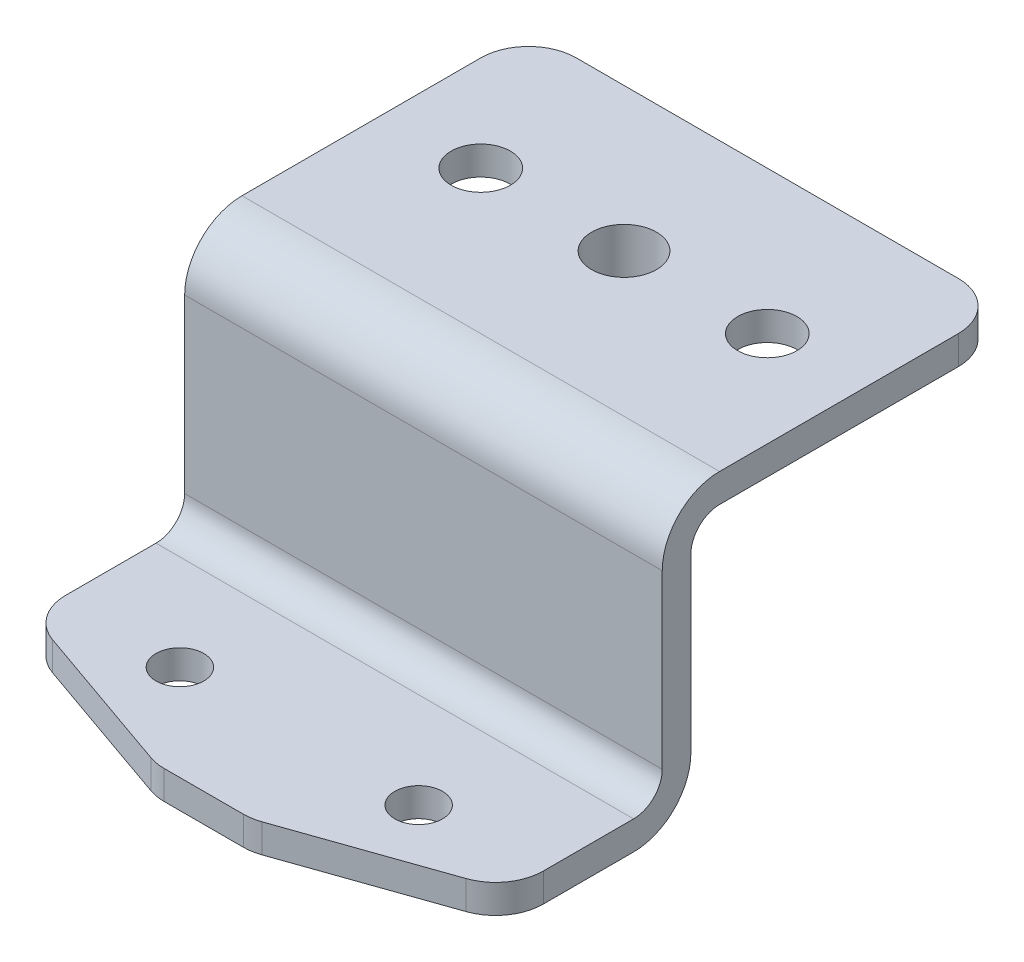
ISO-10303-21;
HEADER;
FILE_DESCRIPTION(('STEP AP214'),'2;1');
FILE_NAME('part.step','',(''),(''),'','','');
FILE_SCHEMA(('AUTOMOTIVE_DESIGN { 1 0 10303 214 1 1 1 1 }'));
ENDSEC;
DATA;
#1=APPLICATION_CONTEXT('core data for automotive mechanical design processes');
#2=APPLICATION_PROTOCOL_DEFINITION('international standard','automotive_design',2000,#1);
#3=PRODUCT_CONTEXT('',#1,'mechanical');
#4=PRODUCT('Part','Part','',(#3));
#5=PRODUCT_RELATED_PRODUCT_CATEGORY('part','',(#4));
#6=PRODUCT_DEFINITION_FORMATION('','',#4);
#7=PRODUCT_DEFINITION_CONTEXT('part definition',#1,'design');
#8=PRODUCT_DEFINITION('design','',#6,#7);
#9=PRODUCT_DEFINITION_SHAPE('','',#8);
#10=(LENGTH_UNIT() NAMED_UNIT(*) SI_UNIT(.MILLI.,.METRE.));
#11=(NAMED_UNIT(*) PLANE_ANGLE_UNIT() SI_UNIT($,.RADIAN.));
#12=(NAMED_UNIT(*) SI_UNIT($,.STERADIAN.) SOLID_ANGLE_UNIT());
#13=UNCERTAINTY_MEASURE_WITH_UNIT(LENGTH_MEASURE(1.E-05),#10,'distance_accuracy_value','');
#14=(GEOMETRIC_REPRESENTATION_CONTEXT(3) GLOBAL_UNCERTAINTY_ASSIGNED_CONTEXT((#13)) GLOBAL_UNIT_ASSIGNED_CONTEXT((#10,
#11,#12)) REPRESENTATION_CONTEXT('',''));
#15=CARTESIAN_POINT('',(0.,0.,0.));
#16=DIRECTION('',(0.,0.,1.));
#17=DIRECTION('',(1.,0.,0.));
#18=AXIS2_PLACEMENT_3D('',#15,#16,#17);
#19=CARTESIAN_POINT('',(29.1502713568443,114.,865.));
#20=DIRECTION('',(0.,-1.,0.));
#21=DIRECTION('',(0.,0.,-1.));
#22=AXIS2_PLACEMENT_3D('',#19,#20,#21);
#23=CYLINDRICAL_SURFACE('',#22,5.);
#24=CARTESIAN_POINT('',(29.1502713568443,114.,865.));
#25=DIRECTION('',(0.,-1.,0.));
#26=DIRECTION('',(0.,0.,-1.));
#27=AXIS2_PLACEMENT_3D('',#24,#25,#26);
#28=CIRCLE('',#27,5.);
#29=CARTESIAN_POINT('',(30.8020234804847,114.,869.71929178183));
#30=VERTEX_POINT('',#29);
#31=CARTESIAN_POINT('',(29.1502713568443,114.,870.));
#32=VERTEX_POINT('',#31);
#33=EDGE_CURVE('E20',#30,#32,#28,.T.);
#34=ORIENTED_EDGE('',*,*,#33,.T.);
#35=DIRECTION('',(0.,1.,0.));
#36=VECTOR('',#35,1.);
#37=CARTESIAN_POINT('',(29.1502713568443,114.,870.));
#38=LINE('',#37,#36);
#39=CARTESIAN_POINT('',(29.1502713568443,111.,870.));
#40=VERTEX_POINT('',#39);
#41=EDGE_CURVE('E157',#40,#32,#38,.T.);
#42=ORIENTED_EDGE('',*,*,#41,.F.);
#43=CARTESIAN_POINT('',(29.1502713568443,111.,865.));
#44=DIRECTION('',(0.,-1.,0.));
#45=DIRECTION('',(0.,0.,-1.));
#46=AXIS2_PLACEMENT_3D('',#43,#44,#45);
#47=CIRCLE('',#46,5.);
#48=CARTESIAN_POINT('',(30.8020234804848,111.,869.71929178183));
#49=VERTEX_POINT('',#48);
#50=EDGE_CURVE('E313',#49,#40,#47,.T.);
#51=ORIENTED_EDGE('',*,*,#50,.F.);
#52=DIRECTION('',(0.,1.,0.));
#53=VECTOR('',#52,1.);
#54=CARTESIAN_POINT('',(30.8020234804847,114.,869.71929178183));
#55=LINE('',#54,#53);
#56=EDGE_CURVE('E160',#49,#30,#55,.T.);
#57=ORIENTED_EDGE('',*,*,#56,.T.);
#58=EDGE_LOOP('',(#34,#42,#51,#57));
#59=FACE_BOUND('',#58,.T.);
#60=ADVANCED_FACE('F17',(#59),#23,.T.);
#61=CARTESIAN_POINT('',(20.8497286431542,114.,865.));
#62=DIRECTION('',(0.,1.,0.));
#63=DIRECTION('',(0.,0.,1.));
#64=AXIS2_PLACEMENT_3D('',#61,#62,#63);
#65=CYLINDRICAL_SURFACE('',#64,5.);
#66=CARTESIAN_POINT('',(20.8497286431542,111.,865.));
#67=DIRECTION('',(0.,1.,0.));
#68=DIRECTION('',(0.,0.,1.));
#69=AXIS2_PLACEMENT_3D('',#66,#67,#68);
#70=CIRCLE('',#69,5.);
#71=CARTESIAN_POINT('',(20.8497286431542,111.,870.));
#72=VERTEX_POINT('',#71);
#73=CARTESIAN_POINT('',(19.1979765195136,111.,869.71929178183));
#74=VERTEX_POINT('',#73);
#75=EDGE_CURVE('E310',#72,#74,#70,.F.);
#76=ORIENTED_EDGE('',*,*,#75,.F.);
#77=DIRECTION('',(0.,1.,0.));
#78=VECTOR('',#77,1.);
#79=CARTESIAN_POINT('',(20.8497286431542,114.,870.));
#80=LINE('',#79,#78);
#81=CARTESIAN_POINT('',(20.8497286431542,114.,870.));
#82=VERTEX_POINT('',#81);
#83=EDGE_CURVE('E215',#82,#72,#80,.F.);
#84=ORIENTED_EDGE('',*,*,#83,.F.);
#85=CARTESIAN_POINT('',(20.8497286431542,114.,865.));
#86=DIRECTION('',(0.,1.,0.));
#87=DIRECTION('',(0.,0.,1.));
#88=AXIS2_PLACEMENT_3D('',#85,#86,#87);
#89=CIRCLE('',#88,5.);
#90=CARTESIAN_POINT('',(19.1979765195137,114.,869.71929178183));
#91=VERTEX_POINT('',#90);
#92=EDGE_CURVE('E162',#82,#91,#89,.F.);
#93=ORIENTED_EDGE('',*,*,#92,.T.);
#94=DIRECTION('',(0.,1.,0.));
#95=VECTOR('',#94,1.);
#96=CARTESIAN_POINT('',(19.1979765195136,114.,869.71929178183));
#97=LINE('',#96,#95);
#98=EDGE_CURVE('E170',#91,#74,#97,.F.);
#99=ORIENTED_EDGE('',*,*,#98,.T.);
#100=EDGE_LOOP('',(#76,#84,#93,#99));
#101=FACE_BOUND('',#100,.T.);
#102=ADVANCED_FACE('F316',(#101),#65,.T.);
#103=CARTESIAN_POINT('',(49.9999999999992,111.,850.));
#104=DIRECTION('',(0.,-1.,0.));
#105=DIRECTION('',(0.,0.,-1.));
#106=AXIS2_PLACEMENT_3D('',#103,#104,#105);
#107=PLANE('',#106);
#108=DIRECTION('',(1.,0.,0.));
#109=VECTOR('',#108,1.);
#110=CARTESIAN_POINT('',(49.9999999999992,111.,870.));
#111=LINE('',#110,#109);
#112=EDGE_CURVE('E169',#72,#40,#111,.T.);
#113=ORIENTED_EDGE('',*,*,#112,.F.);
#114=ORIENTED_EDGE('',*,*,#75,.T.);
#115=DIRECTION('',(-0.943858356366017,0.,-0.330350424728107));
#116=VECTOR('',#115,1.);
#117=CARTESIAN_POINT('',(19.9999999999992,111.,870.));
#118=LINE('',#117,#116);
#119=CARTESIAN_POINT('',(3.34824787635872,111.,864.171886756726));
#120=VERTEX_POINT('',#119);
#121=EDGE_CURVE('E213',#74,#120,#118,.T.);
#122=ORIENTED_EDGE('',*,*,#121,.T.);
#123=CARTESIAN_POINT('',(4.9999999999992,111.,859.452594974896));
#124=DIRECTION('',(0.,-1.,0.));
#125=DIRECTION('',(0.,0.,-1.));
#126=AXIS2_PLACEMENT_3D('',#123,#124,#125);
#127=CIRCLE('',#126,5.);
#128=CARTESIAN_POINT('',(-8.05101612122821E-13,111.,859.452594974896));
#129=VERTEX_POINT('',#128);
#130=EDGE_CURVE('E212',#129,#120,#127,.F.);
#131=ORIENTED_EDGE('',*,*,#130,.F.);
#132=DIRECTION('',(0.,0.,1.));
#133=VECTOR('',#132,1.);
#134=CARTESIAN_POINT('',(-7.97972798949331E-13,111.,870.));
#135=LINE('',#134,#133);
#136=CARTESIAN_POINT('',(-8.04911692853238E-13,111.,850.));
#137=VERTEX_POINT('',#136);
#138=EDGE_CURVE('E203',#137,#129,#135,.T.);
#139=ORIENTED_EDGE('',*,*,#138,.F.);
#140=DIRECTION('',(1.,0.,0.));
#141=VECTOR('',#140,1.);
#142=CARTESIAN_POINT('',(49.9999999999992,111.,850.));
#143=LINE('',#142,#141);
#144=CARTESIAN_POINT('',(49.9999999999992,111.,850.));
#145=VERTEX_POINT('',#144);
#146=EDGE_CURVE('E195',#145,#137,#143,.F.);
#147=ORIENTED_EDGE('',*,*,#146,.F.);
#148=DIRECTION('',(0.,0.,-1.));
#149=VECTOR('',#148,1.);
#150=CARTESIAN_POINT('',(49.9999999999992,111.,850.));
#151=LINE('',#150,#149);
#152=CARTESIAN_POINT('',(49.9999999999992,111.,859.452594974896));
#153=VERTEX_POINT('',#152);
#154=EDGE_CURVE('E199',#153,#145,#151,.T.);
#155=ORIENTED_EDGE('',*,*,#154,.F.);
#156=CARTESIAN_POINT('',(44.9999999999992,111.,859.452594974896));
#157=DIRECTION('',(0.,1.,0.));
#158=DIRECTION('',(0.,0.,1.));
#159=AXIS2_PLACEMENT_3D('',#156,#157,#158);
#160=CIRCLE('',#159,5.);
#161=CARTESIAN_POINT('',(46.6517521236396,111.,864.171886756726));
#162=VERTEX_POINT('',#161);
#163=EDGE_CURVE('E221',#162,#153,#160,.T.);
#164=ORIENTED_EDGE('',*,*,#163,.F.);
#165=DIRECTION('',(-0.943858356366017,0.,0.330350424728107));
#166=VECTOR('',#165,1.);
#167=CARTESIAN_POINT('',(49.9999999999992,111.,863.));
#168=LINE('',#167,#166);
#169=EDGE_CURVE('E220',#162,#49,#168,.T.);
#170=ORIENTED_EDGE('',*,*,#169,.T.);
#171=ORIENTED_EDGE('',*,*,#50,.T.);
#172=EDGE_LOOP('',(#113,#114,#122,#131,#139,#147,#155,#164,#170,#171));
#173=FACE_BOUND('',#172,.T.);
#174=CARTESIAN_POINT('',(12.4999999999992,111.,860.));
#175=DIRECTION('',(0.,-1.,0.));
#176=DIRECTION('',(0.,0.,-1.));
#177=AXIS2_PLACEMENT_3D('',#174,#175,#176);
#178=CIRCLE('',#177,2.5);
#179=CARTESIAN_POINT('',(12.4999999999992,111.,857.5));
#180=VERTEX_POINT('',#179);
#181=EDGE_CURVE('E304',#180,#180,#178,.F.);
#182=ORIENTED_EDGE('',*,*,#181,.T.);
#183=EDGE_LOOP('',(#182));
#184=FACE_BOUND('',#183,.T.);
#185=CARTESIAN_POINT('',(37.4999999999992,111.,860.));
#186=DIRECTION('',(0.,-1.,0.));
#187=DIRECTION('',(0.,0.,-1.));
#188=AXIS2_PLACEMENT_3D('',#185,#186,#187);
#189=CIRCLE('',#188,2.5);
#190=CARTESIAN_POINT('',(37.4999999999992,111.,857.5));
#191=VERTEX_POINT('',#190);
#192=EDGE_CURVE('E307',#191,#191,#189,.F.);
#193=ORIENTED_EDGE('',*,*,#192,.T.);
#194=EDGE_LOOP('',(#193));
#195=FACE_BOUND('',#194,.T.);
#196=ADVANCED_FACE('F330',(#173,#184,#195),#107,.T.);
#197=CARTESIAN_POINT('',(37.4999999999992,114.,860.));
#198=DIRECTION('',(0.,-1.,0.));
#199=DIRECTION('',(0.,0.,-1.));
#200=AXIS2_PLACEMENT_3D('',#197,#198,#199);
#201=CYLINDRICAL_SURFACE('',#200,2.5);
#202=CARTESIAN_POINT('',(37.4999999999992,114.,860.));
#203=DIRECTION('',(0.,-1.,0.));
#204=DIRECTION('',(0.,0.,-1.));
#205=AXIS2_PLACEMENT_3D('',#202,#203,#204);
#206=CIRCLE('',#205,2.5);
#207=CARTESIAN_POINT('',(37.4999999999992,114.,857.5));
#208=VERTEX_POINT('',#207);
#209=EDGE_CURVE('E198',#208,#208,#206,.F.);
#210=ORIENTED_EDGE('',*,*,#209,.T.);
#211=EDGE_LOOP('',(#210));
#212=FACE_BOUND('',#211,.T.);
#213=ORIENTED_EDGE('',*,*,#192,.F.);
#214=EDGE_LOOP('',(#213));
#215=FACE_BOUND('',#214,.T.);
#216=ADVANCED_FACE('F626',(#212,#215),#201,.F.);
#217=CARTESIAN_POINT('',(12.4999999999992,114.,860.));
#218=DIRECTION('',(0.,-1.,0.));
#219=DIRECTION('',(0.,0.,-1.));
#220=AXIS2_PLACEMENT_3D('',#217,#218,#219);
#221=CYLINDRICAL_SURFACE('',#220,2.5);
#222=CARTESIAN_POINT('',(12.4999999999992,114.,860.));
#223=DIRECTION('',(0.,-1.,0.));
#224=DIRECTION('',(0.,0.,-1.));
#225=AXIS2_PLACEMENT_3D('',#222,#223,#224);
#226=CIRCLE('',#225,2.5);
#227=CARTESIAN_POINT('',(12.4999999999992,114.,857.5));
#228=VERTEX_POINT('',#227);
#229=EDGE_CURVE('E189',#228,#228,#226,.F.);
#230=ORIENTED_EDGE('',*,*,#229,.T.);
#231=EDGE_LOOP('',(#230));
#232=FACE_BOUND('',#231,.T.);
#233=ORIENTED_EDGE('',*,*,#181,.F.);
#234=EDGE_LOOP('',(#233));
#235=FACE_BOUND('',#234,.T.);
#236=ADVANCED_FACE('F617',(#232,#235),#221,.F.);
#237=CARTESIAN_POINT('',(44.9999999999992,114.,859.452594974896));
#238=DIRECTION('',(0.,1.,0.));
#239=DIRECTION('',(0.,0.,1.));
#240=AXIS2_PLACEMENT_3D('',#237,#238,#239);
#241=CYLINDRICAL_SURFACE('',#240,5.);
#242=ORIENTED_EDGE('',*,*,#163,.T.);
#243=DIRECTION('',(0.,1.,0.));
#244=VECTOR('',#243,1.);
#245=CARTESIAN_POINT('',(49.9999999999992,114.,859.452594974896));
#246=LINE('',#245,#244);
#247=CARTESIAN_POINT('',(49.9999999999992,114.,859.452594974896));
#248=VERTEX_POINT('',#247);
#249=EDGE_CURVE('E202',#248,#153,#246,.F.);
#250=ORIENTED_EDGE('',*,*,#249,.F.);
#251=CARTESIAN_POINT('',(44.9999999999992,114.,859.452594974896));
#252=DIRECTION('',(0.,1.,0.));
#253=DIRECTION('',(0.,0.,1.));
#254=AXIS2_PLACEMENT_3D('',#251,#252,#253);
#255=CIRCLE('',#254,5.);
#256=CARTESIAN_POINT('',(46.6517521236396,114.,864.171886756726));
#257=VERTEX_POINT('',#256);
#258=EDGE_CURVE('E182',#248,#257,#255,.F.);
#259=ORIENTED_EDGE('',*,*,#258,.T.);
#260=DIRECTION('',(0.,1.,0.));
#261=VECTOR('',#260,1.);
#262=CARTESIAN_POINT('',(46.6517521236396,114.,864.171886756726));
#263=LINE('',#262,#261);
#264=EDGE_CURVE('E217',#257,#162,#263,.F.);
#265=ORIENTED_EDGE('',*,*,#264,.T.);
#266=EDGE_LOOP('',(#242,#250,#259,#265));
#267=FACE_BOUND('',#266,.T.);
#268=ADVANCED_FACE('F608',(#267),#241,.T.);
#269=CARTESIAN_POINT('',(49.9999999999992,114.,863.));
#270=DIRECTION('',(-0.330350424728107,0.,-0.943858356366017));
#271=DIRECTION('',(-0.943858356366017,0.,0.330350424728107));
#272=AXIS2_PLACEMENT_3D('',#269,#270,#271);
#273=PLANE('',#272);
#274=ORIENTED_EDGE('',*,*,#56,.F.);
#275=ORIENTED_EDGE('',*,*,#169,.F.);
#276=ORIENTED_EDGE('',*,*,#264,.F.);
#277=DIRECTION('',(-0.943858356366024,0.,0.330350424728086));
#278=VECTOR('',#277,1.);
#279=CARTESIAN_POINT('',(46.6517521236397,114.,864.171886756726));
#280=LINE('',#279,#278);
#281=EDGE_CURVE('E178',#257,#30,#280,.T.);
#282=ORIENTED_EDGE('',*,*,#281,.T.);
#283=EDGE_LOOP('',(#274,#275,#276,#282));
#284=FACE_BOUND('',#283,.T.);
#285=ADVANCED_FACE('F600',(#284),#273,.F.);
#286=CARTESIAN_POINT('',(49.9999999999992,114.,870.));
#287=DIRECTION('',(0.,0.,1.));
#288=DIRECTION('',(1.,0.,0.));
#289=AXIS2_PLACEMENT_3D('',#286,#287,#288);
#290=PLANE('',#289);
#291=ORIENTED_EDGE('',*,*,#112,.T.);
#292=ORIENTED_EDGE('',*,*,#41,.T.);
#293=DIRECTION('',(1.,0.,0.));
#294=VECTOR('',#293,1.);
#295=CARTESIAN_POINT('',(49.9999999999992,114.,870.));
#296=LINE('',#295,#294);
#297=EDGE_CURVE('E167',#32,#82,#296,.F.);
#298=ORIENTED_EDGE('',*,*,#297,.T.);
#299=ORIENTED_EDGE('',*,*,#83,.T.);
#300=EDGE_LOOP('',(#291,#292,#298,#299));
#301=FACE_BOUND('',#300,.T.);
#302=ADVANCED_FACE('F165',(#301),#290,.T.);
#303=CARTESIAN_POINT('',(19.9999999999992,114.,870.));
#304=DIRECTION('',(0.330350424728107,0.,-0.943858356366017));
#305=DIRECTION('',(-0.943858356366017,0.,-0.330350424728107));
#306=AXIS2_PLACEMENT_3D('',#303,#304,#305);
#307=PLANE('',#306);
#308=DIRECTION('',(0.,-1.,0.));
#309=VECTOR('',#308,1.);
#310=CARTESIAN_POINT('',(3.34824787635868,114.,864.171886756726));
#311=LINE('',#310,#309);
#312=CARTESIAN_POINT('',(3.34824787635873,114.,864.171886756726));
#313=VERTEX_POINT('',#312);
#314=EDGE_CURVE('E207',#120,#313,#311,.F.);
#315=ORIENTED_EDGE('',*,*,#314,.F.);
#316=ORIENTED_EDGE('',*,*,#121,.F.);
#317=ORIENTED_EDGE('',*,*,#98,.F.);
#318=DIRECTION('',(-0.943858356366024,0.,-0.330350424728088));
#319=VECTOR('',#318,1.);
#320=CARTESIAN_POINT('',(19.1979765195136,114.,869.71929178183));
#321=LINE('',#320,#319);
#322=EDGE_CURVE('E177',#91,#313,#321,.T.);
#323=ORIENTED_EDGE('',*,*,#322,.T.);
#324=EDGE_LOOP('',(#315,#316,#317,#323));
#325=FACE_BOUND('',#324,.T.);
#326=ADVANCED_FACE('F320',(#325),#307,.F.);
#327=CARTESIAN_POINT('',(4.9999999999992,114.,859.452594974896));
#328=DIRECTION('',(0.,-1.,0.));
#329=DIRECTION('',(0.,0.,-1.));
#330=AXIS2_PLACEMENT_3D('',#327,#328,#329);
#331=CYLINDRICAL_SURFACE('',#330,5.);
#332=CARTESIAN_POINT('',(4.9999999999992,114.,859.452594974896));
#333=DIRECTION('',(0.,-1.,0.));
#334=DIRECTION('',(0.,0.,-1.));
#335=AXIS2_PLACEMENT_3D('',#332,#333,#334);
#336=CIRCLE('',#335,5.);
#337=CARTESIAN_POINT('',(-8.01442245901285E-13,114.,859.452594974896));
#338=VERTEX_POINT('',#337);
#339=EDGE_CURVE('E180',#313,#338,#336,.T.);
#340=ORIENTED_EDGE('',*,*,#339,.T.);
#341=DIRECTION('',(0.,1.,0.));
#342=VECTOR('',#341,1.);
#343=CARTESIAN_POINT('',(-8.05291531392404E-13,114.,859.452594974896));
#344=LINE('',#343,#342);
#345=EDGE_CURVE('E206',#129,#338,#344,.T.);
#346=ORIENTED_EDGE('',*,*,#345,.F.);
#347=ORIENTED_EDGE('',*,*,#130,.T.);
#348=ORIENTED_EDGE('',*,*,#314,.T.);
#349=EDGE_LOOP('',(#340,#346,#347,#348));
#350=FACE_BOUND('',#349,.T.);
#351=ADVANCED_FACE('F324',(#350),#331,.T.);
#352=CARTESIAN_POINT('',(49.9999999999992,117.,850.));
#353=DIRECTION('',(1.,0.,0.));
#354=DIRECTION('',(0.,0.,-1.));
#355=AXIS2_PLACEMENT_3D('',#352,#353,#354);
#356=CYLINDRICAL_SURFACE('',#355,6.);
#357=DIRECTION('',(1.,0.,0.));
#358=VECTOR('',#357,1.);
#359=CARTESIAN_POINT('',(-7.97972798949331E-13,117.,844.));
#360=LINE('',#359,#358);
#361=CARTESIAN_POINT('',(49.9999999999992,117.,844.));
#362=VERTEX_POINT('',#361);
#363=CARTESIAN_POINT('',(-7.97972798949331E-13,117.,844.));
#364=VERTEX_POINT('',#363);
#365=EDGE_CURVE('E287',#362,#364,#360,.F.);
#366=ORIENTED_EDGE('',*,*,#365,.F.);
#367=CARTESIAN_POINT('',(49.9999999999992,117.,850.));
#368=DIRECTION('',(1.,0.,0.));
#369=DIRECTION('',(0.,0.,-1.));
#370=AXIS2_PLACEMENT_3D('',#367,#368,#369);
#371=CIRCLE('',#370,6.);
#372=EDGE_CURVE('E288',#145,#362,#371,.T.);
#373=ORIENTED_EDGE('',*,*,#372,.F.);
#374=ORIENTED_EDGE('',*,*,#146,.T.);
#375=CARTESIAN_POINT('',(-7.97972798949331E-13,117.,850.));
#376=DIRECTION('',(1.,0.,0.));
#377=DIRECTION('',(0.,0.,-1.));
#378=AXIS2_PLACEMENT_3D('',#375,#376,#377);
#379=CIRCLE('',#378,6.);
#380=EDGE_CURVE('E291',#364,#137,#379,.F.);
#381=ORIENTED_EDGE('',*,*,#380,.F.);
#382=EDGE_LOOP('',(#366,#373,#374,#381));
#383=FACE_BOUND('',#382,.T.);
#384=ADVANCED_FACE('F335',(#383),#356,.T.);
#385=CARTESIAN_POINT('',(49.9999999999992,114.,850.));
#386=DIRECTION('',(0.,-1.,0.));
#387=DIRECTION('',(0.,0.,-1.));
#388=AXIS2_PLACEMENT_3D('',#385,#386,#387);
#389=PLANE('',#388);
#390=ORIENTED_EDGE('',*,*,#339,.F.);
#391=ORIENTED_EDGE('',*,*,#322,.F.);
#392=ORIENTED_EDGE('',*,*,#92,.F.);
#393=ORIENTED_EDGE('',*,*,#297,.F.);
#394=ORIENTED_EDGE('',*,*,#33,.F.);
#395=ORIENTED_EDGE('',*,*,#281,.F.);
#396=ORIENTED_EDGE('',*,*,#258,.F.);
#397=DIRECTION('',(0.,0.,-1.));
#398=VECTOR('',#397,1.);
#399=CARTESIAN_POINT('',(49.9999999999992,114.,850.));
#400=LINE('',#399,#398);
#401=CARTESIAN_POINT('',(49.9999999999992,114.,850.));
#402=VERTEX_POINT('',#401);
#403=EDGE_CURVE('E186',#402,#248,#400,.F.);
#404=ORIENTED_EDGE('',*,*,#403,.F.);
#405=DIRECTION('',(1.,0.,0.));
#406=VECTOR('',#405,1.);
#407=CARTESIAN_POINT('',(49.9999999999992,114.,850.));
#408=LINE('',#407,#406);
#409=CARTESIAN_POINT('',(-7.97972798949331E-13,114.,850.));
#410=VERTEX_POINT('',#409);
#411=EDGE_CURVE('E190',#402,#410,#408,.F.);
#412=ORIENTED_EDGE('',*,*,#411,.T.);
#413=DIRECTION('',(0.,0.,-1.));
#414=VECTOR('',#413,1.);
#415=CARTESIAN_POINT('',(-7.97972798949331E-13,114.,850.));
#416=LINE('',#415,#414);
#417=EDGE_CURVE('E294',#338,#410,#416,.T.);
#418=ORIENTED_EDGE('',*,*,#417,.F.);
#419=EDGE_LOOP('',(#390,#391,#392,#393,#394,#395,#396,#404,#412,#418));
#420=FACE_BOUND('',#419,.T.);
#421=ORIENTED_EDGE('',*,*,#229,.F.);
#422=EDGE_LOOP('',(#421));
#423=FACE_BOUND('',#422,.T.);
#424=ORIENTED_EDGE('',*,*,#209,.F.);
#425=EDGE_LOOP('',(#424));
#426=FACE_BOUND('',#425,.T.);
#427=ADVANCED_FACE('F173',(#420,#423,#426),#389,.F.);
#428=CARTESIAN_POINT('',(-7.97972798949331E-13,117.,844.));
#429=DIRECTION('',(0.,0.,-1.));
#430=DIRECTION('',(0.,1.,0.));
#431=AXIS2_PLACEMENT_3D('',#428,#429,#430);
#432=PLANE('',#431);
#433=DIRECTION('',(-1.,0.,0.));
#434=VECTOR('',#433,1.);
#435=CARTESIAN_POINT('',(-7.97972798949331E-13,135.,844.));
#436=LINE('',#435,#434);
#437=CARTESIAN_POINT('',(-7.97972798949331E-13,135.,844.));
#438=VERTEX_POINT('',#437);
#439=CARTESIAN_POINT('',(49.9999999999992,135.,844.));
#440=VERTEX_POINT('',#439);
#441=EDGE_CURVE('E283',#438,#440,#436,.F.);
#442=ORIENTED_EDGE('',*,*,#441,.T.);
#443=DIRECTION('',(0.,1.,0.));
#444=VECTOR('',#443,1.);
#445=CARTESIAN_POINT('',(49.9999999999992,117.,844.));
#446=LINE('',#445,#444);
#447=EDGE_CURVE('E340',#362,#440,#446,.T.);
#448=ORIENTED_EDGE('',*,*,#447,.F.);
#449=ORIENTED_EDGE('',*,*,#365,.T.);
#450=DIRECTION('',(0.,1.,0.));
#451=VECTOR('',#450,1.);
#452=CARTESIAN_POINT('',(-7.97972798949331E-13,117.,844.));
#453=LINE('',#452,#451);
#454=EDGE_CURVE('E193',#438,#364,#453,.F.);
#455=ORIENTED_EDGE('',*,*,#454,.F.);
#456=EDGE_LOOP('',(#442,#448,#449,#455));
#457=FACE_BOUND('',#456,.T.);
#458=ADVANCED_FACE('F343',(#457),#432,.T.);
#459=CARTESIAN_POINT('',(49.9999999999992,117.,850.));
#460=DIRECTION('',(1.,0.,0.));
#461=DIRECTION('',(0.,0.,-1.));
#462=AXIS2_PLACEMENT_3D('',#459,#460,#461);
#463=CYLINDRICAL_SURFACE('',#462,3.);
#464=CARTESIAN_POINT('',(49.9999999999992,117.,850.));
#465=DIRECTION('',(1.,0.,0.));
#466=DIRECTION('',(0.,0.,-1.));
#467=AXIS2_PLACEMENT_3D('',#464,#465,#466);
#468=CIRCLE('',#467,3.);
#469=CARTESIAN_POINT('',(49.9999999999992,117.,847.));
#470=VERTEX_POINT('',#469);
#471=EDGE_CURVE('E194',#470,#402,#468,.F.);
#472=ORIENTED_EDGE('',*,*,#471,.F.);
#473=DIRECTION('',(1.,0.,0.));
#474=VECTOR('',#473,1.);
#475=CARTESIAN_POINT('',(49.9999999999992,117.,847.));
#476=LINE('',#475,#474);
#477=CARTESIAN_POINT('',(-7.97972798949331E-13,117.,847.));
#478=VERTEX_POINT('',#477);
#479=EDGE_CURVE('E282',#478,#470,#476,.T.);
#480=ORIENTED_EDGE('',*,*,#479,.F.);
#481=CARTESIAN_POINT('',(-7.97972798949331E-13,117.,850.));
#482=DIRECTION('',(1.,0.,0.));
#483=DIRECTION('',(0.,0.,-1.));
#484=AXIS2_PLACEMENT_3D('',#481,#482,#483);
#485=CIRCLE('',#484,3.);
#486=EDGE_CURVE('E285',#410,#478,#485,.T.);
#487=ORIENTED_EDGE('',*,*,#486,.F.);
#488=ORIENTED_EDGE('',*,*,#411,.F.);
#489=EDGE_LOOP('',(#472,#480,#487,#488));
#490=FACE_BOUND('',#489,.T.);
#491=ADVANCED_FACE('F406',(#490),#463,.F.);
#492=CARTESIAN_POINT('',(24.9999999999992,138.,826.));
#493=DIRECTION('',(0.,-1.,0.));
#494=DIRECTION('',(0.,0.,-1.));
#495=AXIS2_PLACEMENT_3D('',#492,#493,#494);
#496=CYLINDRICAL_SURFACE('',#495,6.);
#497=CARTESIAN_POINT('',(24.9999999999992,138.,826.));
#498=DIRECTION('',(0.,-1.,0.));
#499=DIRECTION('',(0.,0.,-1.));
#500=AXIS2_PLACEMENT_3D('',#497,#498,#499);
#501=CIRCLE('',#500,6.);
#502=CARTESIAN_POINT('',(24.9999999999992,138.,820.));
#503=VERTEX_POINT('',#502);
#504=EDGE_CURVE('E269',#503,#503,#501,.F.);
#505=ORIENTED_EDGE('',*,*,#504,.F.);
#506=EDGE_LOOP('',(#505));
#507=FACE_BOUND('',#506,.T.);
#508=CARTESIAN_POINT('',(24.9999999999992,134.,826.));
#509=DIRECTION('',(0.,-1.,0.));
#510=DIRECTION('',(0.,0.,-1.));
#511=AXIS2_PLACEMENT_3D('',#508,#509,#510);
#512=CIRCLE('',#511,6.);
#513=CARTESIAN_POINT('',(24.9999999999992,134.,820.));
#514=VERTEX_POINT('',#513);
#515=EDGE_CURVE('E279',#514,#514,#512,.T.);
#516=ORIENTED_EDGE('',*,*,#515,.F.);
#517=EDGE_LOOP('',(#516));
#518=FACE_BOUND('',#517,.T.);
#519=ADVANCED_FACE('F542',(#507,#518),#496,.T.);
#520=CARTESIAN_POINT('',(-7.97972798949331E-13,135.,841.));
#521=DIRECTION('',(-1.,0.,0.));
#522=DIRECTION('',(0.,0.,1.));
#523=AXIS2_PLACEMENT_3D('',#520,#521,#522);
#524=CYLINDRICAL_SURFACE('',#523,3.);
#525=CARTESIAN_POINT('',(-7.97972798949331E-13,135.,841.));
#526=DIRECTION('',(-1.,0.,0.));
#527=DIRECTION('',(0.,0.,1.));
#528=AXIS2_PLACEMENT_3D('',#525,#526,#527);
#529=CIRCLE('',#528,3.);
#530=CARTESIAN_POINT('',(-7.97972798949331E-13,138.,841.));
#531=VERTEX_POINT('',#530);
#532=EDGE_CURVE('E275',#531,#438,#529,.F.);
#533=ORIENTED_EDGE('',*,*,#532,.F.);
#534=DIRECTION('',(1.,0.,0.));
#535=VECTOR('',#534,1.);
#536=CARTESIAN_POINT('',(-7.97972798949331E-13,138.,841.));
#537=LINE('',#536,#535);
#538=CARTESIAN_POINT('',(49.9999999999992,138.,841.));
#539=VERTEX_POINT('',#538);
#540=EDGE_CURVE('E268',#539,#531,#537,.F.);
#541=ORIENTED_EDGE('',*,*,#540,.F.);
#542=CARTESIAN_POINT('',(49.9999999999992,135.,841.));
#543=DIRECTION('',(-1.,0.,0.));
#544=DIRECTION('',(0.,0.,1.));
#545=AXIS2_PLACEMENT_3D('',#542,#543,#544);
#546=CIRCLE('',#545,3.);
#547=EDGE_CURVE('E272',#440,#539,#546,.T.);
#548=ORIENTED_EDGE('',*,*,#547,.F.);
#549=ORIENTED_EDGE('',*,*,#441,.F.);
#550=EDGE_LOOP('',(#533,#541,#548,#549));
#551=FACE_BOUND('',#550,.T.);
#552=ADVANCED_FACE('F383',(#551),#524,.F.);
#553=CARTESIAN_POINT('',(24.9999999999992,134.,826.));
#554=DIRECTION('',(0.,-1.,0.));
#555=DIRECTION('',(0.,0.,-1.));
#556=AXIS2_PLACEMENT_3D('',#553,#554,#555);
#557=PLANE('',#556);
#558=ORIENTED_EDGE('',*,*,#515,.T.);
#559=EDGE_LOOP('',(#558));
#560=FACE_BOUND('',#559,.T.);
#561=CARTESIAN_POINT('',(24.9999999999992,134.,826.));
#562=DIRECTION('',(0.,1.,0.));
#563=DIRECTION('',(0.,0.,1.));
#564=AXIS2_PLACEMENT_3D('',#561,#562,#563);
#565=CIRCLE('',#564,3.4);
#566=CARTESIAN_POINT('',(24.9999999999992,134.,829.4));
#567=VERTEX_POINT('',#566);
#568=EDGE_CURVE('E258',#567,#567,#565,.T.);
#569=ORIENTED_EDGE('',*,*,#568,.T.);
#570=EDGE_LOOP('',(#569));
#571=FACE_BOUND('',#570,.T.);
#572=ADVANCED_FACE('F409',(#560,#571),#557,.T.);
#573=CARTESIAN_POINT('',(49.9999999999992,117.,847.));
#574=DIRECTION('',(0.,0.,1.));
#575=DIRECTION('',(0.,-1.,0.));
#576=AXIS2_PLACEMENT_3D('',#573,#574,#575);
#577=PLANE('',#576);
#578=DIRECTION('',(-1.,0.,0.));
#579=VECTOR('',#578,1.);
#580=CARTESIAN_POINT('',(-7.97972798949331E-13,135.,847.));
#581=LINE('',#580,#579);
#582=CARTESIAN_POINT('',(-7.97972798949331E-13,135.,847.));
#583=VERTEX_POINT('',#582);
#584=CARTESIAN_POINT('',(49.9999999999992,135.,847.));
#585=VERTEX_POINT('',#584);
#586=EDGE_CURVE('E253',#583,#585,#581,.F.);
#587=ORIENTED_EDGE('',*,*,#586,.F.);
#588=DIRECTION('',(0.,-1.,0.));
#589=VECTOR('',#588,1.);
#590=CARTESIAN_POINT('',(-7.97972798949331E-13,117.,847.));
#591=LINE('',#590,#589);
#592=EDGE_CURVE('E278',#583,#478,#591,.T.);
#593=ORIENTED_EDGE('',*,*,#592,.T.);
#594=ORIENTED_EDGE('',*,*,#479,.T.);
#595=DIRECTION('',(0.,-1.,0.));
#596=VECTOR('',#595,1.);
#597=CARTESIAN_POINT('',(49.9999999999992,117.,847.));
#598=LINE('',#597,#596);
#599=EDGE_CURVE('E352',#470,#585,#598,.F.);
#600=ORIENTED_EDGE('',*,*,#599,.T.);
#601=EDGE_LOOP('',(#587,#593,#594,#600));
#602=FACE_BOUND('',#601,.T.);
#603=ADVANCED_FACE('F407',(#602),#577,.T.);
#604=CARTESIAN_POINT('',(-7.97972798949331E-13,138.,841.));
#605=DIRECTION('',(0.,-1.,0.));
#606=DIRECTION('',(0.,0.,-1.));
#607=AXIS2_PLACEMENT_3D('',#604,#605,#606);
#608=PLANE('',#607);
#609=DIRECTION('',(0.,0.,-1.));
#610=VECTOR('',#609,1.);
#611=CARTESIAN_POINT('',(49.9999999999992,138.,841.));
#612=LINE('',#611,#610);
#613=CARTESIAN_POINT('',(49.9999999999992,138.,816.));
#614=VERTEX_POINT('',#613);
#615=EDGE_CURVE('E247',#539,#614,#612,.T.);
#616=ORIENTED_EDGE('',*,*,#615,.F.);
#617=ORIENTED_EDGE('',*,*,#540,.T.);
#618=DIRECTION('',(0.,0.,1.));
#619=VECTOR('',#618,1.);
#620=CARTESIAN_POINT('',(-7.97972798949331E-13,138.,841.));
#621=LINE('',#620,#619);
#622=CARTESIAN_POINT('',(-7.97972798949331E-13,138.,816.));
#623=VERTEX_POINT('',#622);
#624=EDGE_CURVE('E362',#623,#531,#621,.T.);
#625=ORIENTED_EDGE('',*,*,#624,.F.);
#626=CARTESIAN_POINT('',(4.9999999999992,138.,816.));
#627=DIRECTION('',(0.,-1.,0.));
#628=DIRECTION('',(0.,0.,-1.));
#629=AXIS2_PLACEMENT_3D('',#626,#627,#628);
#630=CIRCLE('',#629,5.);
#631=CARTESIAN_POINT('',(4.9999999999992,138.,811.));
#632=VERTEX_POINT('',#631);
#633=EDGE_CURVE('E254',#632,#623,#630,.F.);
#634=ORIENTED_EDGE('',*,*,#633,.F.);
#635=DIRECTION('',(1.,0.,0.));
#636=VECTOR('',#635,1.);
#637=CARTESIAN_POINT('',(49.9999999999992,138.,811.));
#638=LINE('',#637,#636);
#639=CARTESIAN_POINT('',(44.9999999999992,138.,811.));
#640=VERTEX_POINT('',#639);
#641=EDGE_CURVE('E261',#640,#632,#638,.F.);
#642=ORIENTED_EDGE('',*,*,#641,.F.);
#643=CARTESIAN_POINT('',(44.9999999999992,138.,816.));
#644=DIRECTION('',(0.,1.,0.));
#645=DIRECTION('',(0.,0.,1.));
#646=AXIS2_PLACEMENT_3D('',#643,#644,#645);
#647=CIRCLE('',#646,5.);
#648=EDGE_CURVE('E243',#614,#640,#647,.T.);
#649=ORIENTED_EDGE('',*,*,#648,.F.);
#650=EDGE_LOOP('',(#616,#617,#625,#634,#642,#649));
#651=FACE_BOUND('',#650,.T.);
#652=ORIENTED_EDGE('',*,*,#504,.T.);
#653=EDGE_LOOP('',(#652));
#654=FACE_BOUND('',#653,.T.);
#655=CARTESIAN_POINT('',(39.9999999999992,138.,826.));
#656=DIRECTION('',(0.,-1.,0.));
#657=DIRECTION('',(0.,0.,-1.));
#658=AXIS2_PLACEMENT_3D('',#655,#656,#657);
#659=CIRCLE('',#658,3.1);
#660=CARTESIAN_POINT('',(39.9999999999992,138.,822.9));
#661=VERTEX_POINT('',#660);
#662=EDGE_CURVE('E262',#661,#661,#659,.F.);
#663=ORIENTED_EDGE('',*,*,#662,.T.);
#664=EDGE_LOOP('',(#663));
#665=FACE_BOUND('',#664,.T.);
#666=CARTESIAN_POINT('',(9.9999999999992,138.,826.));
#667=DIRECTION('',(0.,-1.,0.));
#668=DIRECTION('',(0.,0.,-1.));
#669=AXIS2_PLACEMENT_3D('',#666,#667,#668);
#670=CIRCLE('',#669,3.1);
#671=CARTESIAN_POINT('',(9.9999999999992,138.,822.9));
#672=VERTEX_POINT('',#671);
#673=EDGE_CURVE('E265',#672,#672,#670,.F.);
#674=ORIENTED_EDGE('',*,*,#673,.T.);
#675=EDGE_LOOP('',(#674));
#676=FACE_BOUND('',#675,.T.);
#677=ADVANCED_FACE('F379',(#651,#654,#665,#676),#608,.T.);
#678=CARTESIAN_POINT('',(9.9999999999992,141.,826.));
#679=DIRECTION('',(0.,-1.,0.));
#680=DIRECTION('',(0.,0.,-1.));
#681=AXIS2_PLACEMENT_3D('',#678,#679,#680);
#682=CYLINDRICAL_SURFACE('',#681,3.1);
#683=CARTESIAN_POINT('',(9.9999999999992,141.,826.));
#684=DIRECTION('',(0.,-1.,0.));
#685=DIRECTION('',(0.,0.,-1.));
#686=AXIS2_PLACEMENT_3D('',#683,#684,#685);
#687=CIRCLE('',#686,3.1);
#688=CARTESIAN_POINT('',(9.9999999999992,141.,822.9));
#689=VERTEX_POINT('',#688);
#690=EDGE_CURVE('E240',#689,#689,#687,.T.);
#691=ORIENTED_EDGE('',*,*,#690,.F.);
#692=EDGE_LOOP('',(#691));
#693=FACE_BOUND('',#692,.T.);
#694=ORIENTED_EDGE('',*,*,#673,.F.);
#695=EDGE_LOOP('',(#694));
#696=FACE_BOUND('',#695,.T.);
#697=ADVANCED_FACE('F416',(#693,#696),#682,.F.);
#698=CARTESIAN_POINT('',(39.9999999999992,141.,826.));
#699=DIRECTION('',(0.,-1.,0.));
#700=DIRECTION('',(0.,0.,-1.));
#701=AXIS2_PLACEMENT_3D('',#698,#699,#700);
#702=CYLINDRICAL_SURFACE('',#701,3.1);
#703=CARTESIAN_POINT('',(39.9999999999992,141.,826.));
#704=DIRECTION('',(0.,-1.,0.));
#705=DIRECTION('',(0.,0.,-1.));
#706=AXIS2_PLACEMENT_3D('',#703,#704,#705);
#707=CIRCLE('',#706,3.1);
#708=CARTESIAN_POINT('',(39.9999999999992,141.,822.9));
#709=VERTEX_POINT('',#708);
#710=EDGE_CURVE('E237',#709,#709,#707,.T.);
#711=ORIENTED_EDGE('',*,*,#710,.F.);
#712=EDGE_LOOP('',(#711));
#713=FACE_BOUND('',#712,.T.);
#714=ORIENTED_EDGE('',*,*,#662,.F.);
#715=EDGE_LOOP('',(#714));
#716=FACE_BOUND('',#715,.T.);
#717=ADVANCED_FACE('F444',(#713,#716),#702,.F.);
#718=CARTESIAN_POINT('',(24.9999999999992,134.,826.));
#719=DIRECTION('',(0.,1.,0.));
#720=DIRECTION('',(0.,0.,1.));
#721=AXIS2_PLACEMENT_3D('',#718,#719,#720);
#722=CYLINDRICAL_SURFACE('',#721,3.4);
#723=ORIENTED_EDGE('',*,*,#568,.F.);
#724=EDGE_LOOP('',(#723));
#725=FACE_BOUND('',#724,.T.);
#726=CARTESIAN_POINT('',(24.9999999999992,141.,826.));
#727=DIRECTION('',(0.,1.,0.));
#728=DIRECTION('',(0.,0.,1.));
#729=AXIS2_PLACEMENT_3D('',#726,#727,#728);
#730=CIRCLE('',#729,3.4);
#731=CARTESIAN_POINT('',(24.9999999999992,141.,829.4));
#732=VERTEX_POINT('',#731);
#733=EDGE_CURVE('E234',#732,#732,#730,.F.);
#734=ORIENTED_EDGE('',*,*,#733,.F.);
#735=EDGE_LOOP('',(#734));
#736=FACE_BOUND('',#735,.T.);
#737=ADVANCED_FACE('F440',(#725,#736),#722,.F.);
#738=CARTESIAN_POINT('',(49.9999999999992,138.,811.));
#739=DIRECTION('',(0.,0.,-1.));
#740=DIRECTION('',(0.,1.,0.));
#741=AXIS2_PLACEMENT_3D('',#738,#739,#740);
#742=PLANE('',#741);
#743=DIRECTION('',(1.,0.,0.));
#744=VECTOR('',#743,1.);
#745=CARTESIAN_POINT('',(49.9999999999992,141.,811.));
#746=LINE('',#745,#744);
#747=CARTESIAN_POINT('',(44.9999999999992,141.,811.));
#748=VERTEX_POINT('',#747);
#749=CARTESIAN_POINT('',(4.9999999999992,141.,811.));
#750=VERTEX_POINT('',#749);
#751=EDGE_CURVE('E233',#748,#750,#746,.F.);
#752=ORIENTED_EDGE('',*,*,#751,.F.);
#753=DIRECTION('',(0.,1.,0.));
#754=VECTOR('',#753,1.);
#755=CARTESIAN_POINT('',(44.9999999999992,138.,811.));
#756=LINE('',#755,#754);
#757=EDGE_CURVE('E246',#640,#748,#756,.T.);
#758=ORIENTED_EDGE('',*,*,#757,.F.);
#759=ORIENTED_EDGE('',*,*,#641,.T.);
#760=DIRECTION('',(0.,-1.,0.));
#761=VECTOR('',#760,1.);
#762=CARTESIAN_POINT('',(4.9999999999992,141.,811.));
#763=LINE('',#762,#761);
#764=EDGE_CURVE('E257',#750,#632,#763,.T.);
#765=ORIENTED_EDGE('',*,*,#764,.F.);
#766=EDGE_LOOP('',(#752,#758,#759,#765));
#767=FACE_BOUND('',#766,.T.);
#768=ADVANCED_FACE('F436',(#767),#742,.T.);
#769=CARTESIAN_POINT('',(4.9999999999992,141.,816.));
#770=DIRECTION('',(0.,-1.,0.));
#771=DIRECTION('',(0.,0.,-1.));
#772=AXIS2_PLACEMENT_3D('',#769,#770,#771);
#773=CYLINDRICAL_SURFACE('',#772,5.);
#774=ORIENTED_EDGE('',*,*,#633,.T.);
#775=DIRECTION('',(0.,1.,0.));
#776=VECTOR('',#775,1.);
#777=CARTESIAN_POINT('',(-7.97972798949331E-13,141.,816.));
#778=LINE('',#777,#776);
#779=CARTESIAN_POINT('',(-7.97972798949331E-13,141.,816.));
#780=VERTEX_POINT('',#779);
#781=EDGE_CURVE('E256',#780,#623,#778,.F.);
#782=ORIENTED_EDGE('',*,*,#781,.F.);
#783=CARTESIAN_POINT('',(4.9999999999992,141.,816.));
#784=DIRECTION('',(0.,-1.,0.));
#785=DIRECTION('',(0.,0.,-1.));
#786=AXIS2_PLACEMENT_3D('',#783,#784,#785);
#787=CIRCLE('',#786,5.);
#788=EDGE_CURVE('E229',#750,#780,#787,.F.);
#789=ORIENTED_EDGE('',*,*,#788,.F.);
#790=ORIENTED_EDGE('',*,*,#764,.T.);
#791=EDGE_LOOP('',(#774,#782,#789,#790));
#792=FACE_BOUND('',#791,.T.);
#793=ADVANCED_FACE('F433',(#792),#773,.T.);
#794=CARTESIAN_POINT('',(-7.97972798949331E-13,141.,841.));
#795=DIRECTION('',(-1.,0.,0.));
#796=DIRECTION('',(0.,0.,1.));
#797=AXIS2_PLACEMENT_3D('',#794,#795,#796);
#798=PLANE('',#797);
#799=ORIENTED_EDGE('',*,*,#624,.T.);
#800=ORIENTED_EDGE('',*,*,#532,.T.);
#801=ORIENTED_EDGE('',*,*,#454,.T.);
#802=ORIENTED_EDGE('',*,*,#380,.T.);
#803=ORIENTED_EDGE('',*,*,#138,.T.);
#804=ORIENTED_EDGE('',*,*,#345,.T.);
#805=ORIENTED_EDGE('',*,*,#417,.T.);
#806=ORIENTED_EDGE('',*,*,#486,.T.);
#807=ORIENTED_EDGE('',*,*,#592,.F.);
#808=CARTESIAN_POINT('',(-7.97972798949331E-13,135.,841.));
#809=DIRECTION('',(-1.,0.,0.));
#810=DIRECTION('',(0.,0.,1.));
#811=AXIS2_PLACEMENT_3D('',#808,#809,#810);
#812=CIRCLE('',#811,6.);
#813=CARTESIAN_POINT('',(-7.97972798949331E-13,141.,841.));
#814=VERTEX_POINT('',#813);
#815=EDGE_CURVE('E248',#814,#583,#812,.F.);
#816=ORIENTED_EDGE('',*,*,#815,.F.);
#817=DIRECTION('',(0.,0.,1.));
#818=VECTOR('',#817,1.);
#819=CARTESIAN_POINT('',(-7.97972798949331E-13,141.,841.));
#820=LINE('',#819,#818);
#821=EDGE_CURVE('E232',#780,#814,#820,.T.);
#822=ORIENTED_EDGE('',*,*,#821,.F.);
#823=ORIENTED_EDGE('',*,*,#781,.T.);
#824=EDGE_LOOP('',(#799,#800,#801,#802,#803,#804,#805,#806,#807,#816,#822,#823));
#825=FACE_BOUND('',#824,.T.);
#826=ADVANCED_FACE('F327',(#825),#798,.T.);
#827=CARTESIAN_POINT('',(-7.97972798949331E-13,135.,841.));
#828=DIRECTION('',(-1.,0.,0.));
#829=DIRECTION('',(0.,0.,1.));
#830=AXIS2_PLACEMENT_3D('',#827,#828,#829);
#831=CYLINDRICAL_SURFACE('',#830,6.);
#832=DIRECTION('',(1.,0.,0.));
#833=VECTOR('',#832,1.);
#834=CARTESIAN_POINT('',(49.9999999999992,141.,841.));
#835=LINE('',#834,#833);
#836=CARTESIAN_POINT('',(49.9999999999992,141.,841.));
#837=VERTEX_POINT('',#836);
#838=EDGE_CURVE('E370',#814,#837,#835,.T.);
#839=ORIENTED_EDGE('',*,*,#838,.F.);
#840=ORIENTED_EDGE('',*,*,#815,.T.);
#841=ORIENTED_EDGE('',*,*,#586,.T.);
#842=CARTESIAN_POINT('',(49.9999999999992,135.,841.));
#843=DIRECTION('',(-1.,0.,0.));
#844=DIRECTION('',(0.,0.,1.));
#845=AXIS2_PLACEMENT_3D('',#842,#843,#844);
#846=CIRCLE('',#845,6.);
#847=EDGE_CURVE('E251',#585,#837,#846,.T.);
#848=ORIENTED_EDGE('',*,*,#847,.T.);
#849=EDGE_LOOP('',(#839,#840,#841,#848));
#850=FACE_BOUND('',#849,.T.);
#851=ADVANCED_FACE('F400',(#850),#831,.T.);
#852=CARTESIAN_POINT('',(49.9999999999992,138.,841.));
#853=DIRECTION('',(1.,0.,0.));
#854=DIRECTION('',(0.,0.,-1.));
#855=AXIS2_PLACEMENT_3D('',#852,#853,#854);
#856=PLANE('',#855);
#857=DIRECTION('',(0.,0.,1.));
#858=VECTOR('',#857,1.);
#859=CARTESIAN_POINT('',(49.9999999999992,141.,841.));
#860=LINE('',#859,#858);
#861=CARTESIAN_POINT('',(49.9999999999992,141.,816.));
#862=VERTEX_POINT('',#861);
#863=EDGE_CURVE('E26',#837,#862,#860,.F.);
#864=ORIENTED_EDGE('',*,*,#863,.F.);
#865=ORIENTED_EDGE('',*,*,#847,.F.);
#866=ORIENTED_EDGE('',*,*,#599,.F.);
#867=ORIENTED_EDGE('',*,*,#471,.T.);
#868=ORIENTED_EDGE('',*,*,#403,.T.);
#869=ORIENTED_EDGE('',*,*,#249,.T.);
#870=ORIENTED_EDGE('',*,*,#154,.T.);
#871=ORIENTED_EDGE('',*,*,#372,.T.);
#872=ORIENTED_EDGE('',*,*,#447,.T.);
#873=ORIENTED_EDGE('',*,*,#547,.T.);
#874=ORIENTED_EDGE('',*,*,#615,.T.);
#875=DIRECTION('',(0.,1.,0.));
#876=VECTOR('',#875,1.);
#877=CARTESIAN_POINT('',(49.9999999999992,138.,816.));
#878=LINE('',#877,#876);
#879=EDGE_CURVE('E35',#862,#614,#878,.F.);
#880=ORIENTED_EDGE('',*,*,#879,.F.);
#881=EDGE_LOOP('',(#864,#865,#866,#867,#868,#869,#870,#871,#872,#873,#874,#880));
#882=FACE_BOUND('',#881,.T.);
#883=ADVANCED_FACE('F339',(#882),#856,.T.);
#884=CARTESIAN_POINT('',(44.9999999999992,138.,816.));
#885=DIRECTION('',(0.,1.,0.));
#886=DIRECTION('',(0.,0.,1.));
#887=AXIS2_PLACEMENT_3D('',#884,#885,#886);
#888=CYLINDRICAL_SURFACE('',#887,5.);
#889=CARTESIAN_POINT('',(44.9999999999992,141.,816.));
#890=DIRECTION('',(0.,1.,0.));
#891=DIRECTION('',(0.,0.,1.));
#892=AXIS2_PLACEMENT_3D('',#889,#890,#891);
#893=CIRCLE('',#892,5.);
#894=EDGE_CURVE('E11',#862,#748,#893,.T.);
#895=ORIENTED_EDGE('',*,*,#894,.F.);
#896=ORIENTED_EDGE('',*,*,#879,.T.);
#897=ORIENTED_EDGE('',*,*,#648,.T.);
#898=ORIENTED_EDGE('',*,*,#757,.T.);
#899=EDGE_LOOP('',(#895,#896,#897,#898));
#900=FACE_BOUND('',#899,.T.);
#901=ADVANCED_FACE('F385',(#900),#888,.T.);
#902=CARTESIAN_POINT('',(49.9999999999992,141.,841.));
#903=DIRECTION('',(0.,1.,0.));
#904=DIRECTION('',(0.,0.,1.));
#905=AXIS2_PLACEMENT_3D('',#902,#903,#904);
#906=PLANE('',#905);
#907=ORIENTED_EDGE('',*,*,#863,.T.);
#908=ORIENTED_EDGE('',*,*,#894,.T.);
#909=ORIENTED_EDGE('',*,*,#751,.T.);
#910=ORIENTED_EDGE('',*,*,#788,.T.);
#911=ORIENTED_EDGE('',*,*,#821,.T.);
#912=ORIENTED_EDGE('',*,*,#838,.T.);
#913=EDGE_LOOP('',(#907,#908,#909,#910,#911,#912));
#914=FACE_BOUND('',#913,.T.);
#915=ORIENTED_EDGE('',*,*,#733,.T.);
#916=EDGE_LOOP('',(#915));
#917=FACE_BOUND('',#916,.T.);
#918=ORIENTED_EDGE('',*,*,#710,.T.);
#919=EDGE_LOOP('',(#918));
#920=FACE_BOUND('',#919,.T.);
#921=ORIENTED_EDGE('',*,*,#690,.T.);
#922=EDGE_LOOP('',(#921));
#923=FACE_BOUND('',#922,.T.);
#924=ADVANCED_FACE('F397',(#914,#917,#920,#923),#906,.T.);
#925=CLOSED_SHELL('',(#60,#102,#196,#216,#236,#268,#285,#302,#326,#351,#384,#427,#458,#491,#519,
#552,#572,#603,#677,#697,#717,#737,#768,#793,#826,#851,#883,#901,#924));
#926=MANIFOLD_SOLID_BREP('B1',#925);
#927=ADVANCED_BREP_SHAPE_REPRESENTATION('',(#18,#926),#14);
#928=SHAPE_DEFINITION_REPRESENTATION(#9,#927);
ENDSEC;
END-ISO-10303-21;
